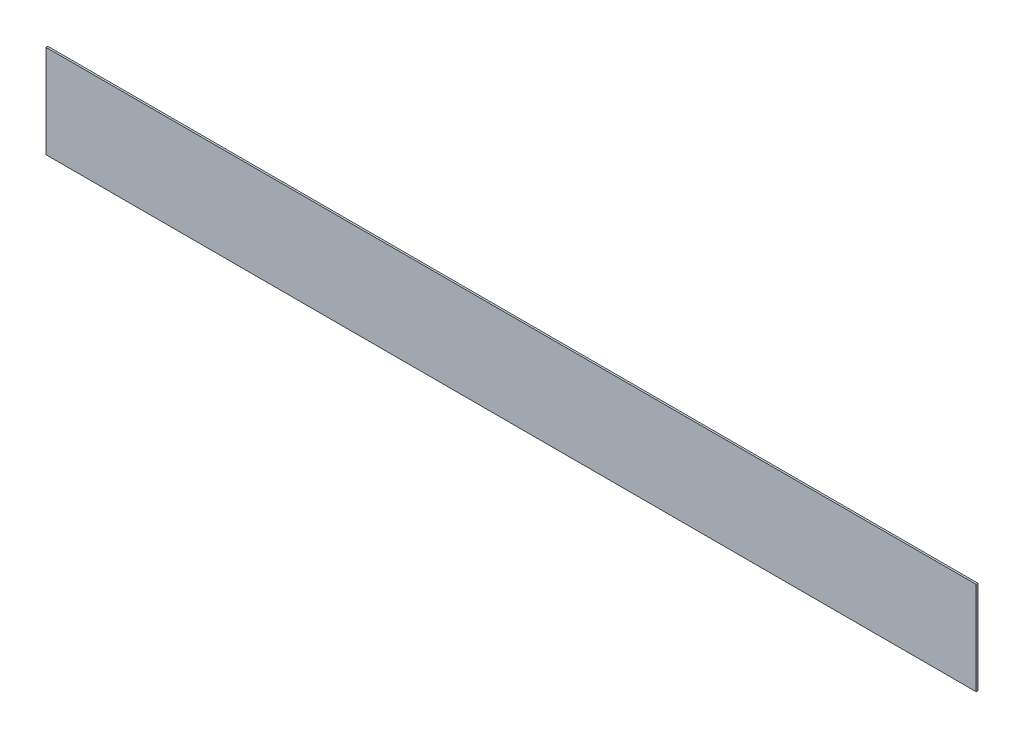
ISO-10303-21;
HEADER;
FILE_DESCRIPTION(('STEP AP214'),'2;1');
FILE_NAME('part.step','',(''),(''),'','','');
FILE_SCHEMA(('AUTOMOTIVE_DESIGN { 1 0 10303 214 1 1 1 1 }'));
ENDSEC;
DATA;
#1=APPLICATION_CONTEXT('core data for automotive mechanical design processes');
#2=APPLICATION_PROTOCOL_DEFINITION('international standard','automotive_design',2000,#1);
#3=PRODUCT_CONTEXT('',#1,'mechanical');
#4=PRODUCT('Part','Part','',(#3));
#5=PRODUCT_RELATED_PRODUCT_CATEGORY('part','',(#4));
#6=PRODUCT_DEFINITION_FORMATION('','',#4);
#7=PRODUCT_DEFINITION_CONTEXT('part definition',#1,'design');
#8=PRODUCT_DEFINITION('design','',#6,#7);
#9=PRODUCT_DEFINITION_SHAPE('','',#8);
#10=(LENGTH_UNIT() NAMED_UNIT(*) SI_UNIT(.MILLI.,.METRE.));
#11=(NAMED_UNIT(*) PLANE_ANGLE_UNIT() SI_UNIT($,.RADIAN.));
#12=(NAMED_UNIT(*) SI_UNIT($,.STERADIAN.) SOLID_ANGLE_UNIT());
#13=UNCERTAINTY_MEASURE_WITH_UNIT(LENGTH_MEASURE(1.E-05),#10,'distance_accuracy_value','');
#14=(GEOMETRIC_REPRESENTATION_CONTEXT(3) GLOBAL_UNCERTAINTY_ASSIGNED_CONTEXT((#13)) GLOBAL_UNIT_ASSIGNED_CONTEXT((#10,
#11,#12)) REPRESENTATION_CONTEXT('',''));
#15=CARTESIAN_POINT('',(0.,0.,0.));
#16=DIRECTION('',(0.,0.,1.));
#17=DIRECTION('',(1.,0.,0.));
#18=AXIS2_PLACEMENT_3D('',#15,#16,#17);
#19=CARTESIAN_POINT('',(0.,0.,10.));
#20=DIRECTION('',(1.,0.,0.));
#21=DIRECTION('',(0.,0.,-1.));
#22=AXIS2_PLACEMENT_3D('',#19,#20,#21);
#23=PLANE('',#22);
#24=DIRECTION('',(0.,-1.,0.));
#25=VECTOR('',#24,1.);
#26=CARTESIAN_POINT('',(0.,0.,0.));
#27=LINE('',#26,#25);
#28=CARTESIAN_POINT('',(0.,500.,0.));
#29=VERTEX_POINT('',#28);
#30=CARTESIAN_POINT('',(0.,0.,0.));
#31=VERTEX_POINT('',#30);
#32=EDGE_CURVE('E95',#29,#31,#27,.T.);
#33=ORIENTED_EDGE('',*,*,#32,.T.);
#34=DIRECTION('',(0.,0.,-1.));
#35=VECTOR('',#34,1.);
#36=CARTESIAN_POINT('',(0.,0.,10.));
#37=LINE('',#36,#35);
#38=CARTESIAN_POINT('',(0.,0.,10.));
#39=VERTEX_POINT('',#38);
#40=EDGE_CURVE('E11',#39,#31,#37,.T.);
#41=ORIENTED_EDGE('',*,*,#40,.F.);
#42=DIRECTION('',(0.,-1.,0.));
#43=VECTOR('',#42,1.);
#44=CARTESIAN_POINT('',(0.,0.,10.));
#45=LINE('',#44,#43);
#46=CARTESIAN_POINT('',(0.,500.,10.));
#47=VERTEX_POINT('',#46);
#48=EDGE_CURVE('E83',#47,#39,#45,.T.);
#49=ORIENTED_EDGE('',*,*,#48,.F.);
#50=DIRECTION('',(0.,0.,-1.));
#51=VECTOR('',#50,1.);
#52=CARTESIAN_POINT('',(0.,500.,10.));
#53=LINE('',#52,#51);
#54=EDGE_CURVE('E91',#47,#29,#53,.T.);
#55=ORIENTED_EDGE('',*,*,#54,.T.);
#56=EDGE_LOOP('',(#33,#41,#49,#55));
#57=FACE_BOUND('',#56,.T.);
#58=ADVANCED_FACE('F32',(#57),#23,.F.);
#59=CARTESIAN_POINT('',(0.,0.,10.));
#60=DIRECTION('',(0.,1.,0.));
#61=DIRECTION('',(0.,0.,1.));
#62=AXIS2_PLACEMENT_3D('',#59,#60,#61);
#63=PLANE('',#62);
#64=DIRECTION('',(1.,0.,0.));
#65=VECTOR('',#64,1.);
#66=CARTESIAN_POINT('',(0.,0.,0.));
#67=LINE('',#66,#65);
#68=CARTESIAN_POINT('',(5000.,0.,0.));
#69=VERTEX_POINT('',#68);
#70=EDGE_CURVE('E87',#31,#69,#67,.T.);
#71=ORIENTED_EDGE('',*,*,#70,.T.);
#72=DIRECTION('',(0.,0.,-1.));
#73=VECTOR('',#72,1.);
#74=CARTESIAN_POINT('',(5000.,0.,10.));
#75=LINE('',#74,#73);
#76=CARTESIAN_POINT('',(5000.,0.,10.));
#77=VERTEX_POINT('',#76);
#78=EDGE_CURVE('E40',#77,#69,#75,.T.);
#79=ORIENTED_EDGE('',*,*,#78,.F.);
#80=DIRECTION('',(1.,0.,0.));
#81=VECTOR('',#80,1.);
#82=CARTESIAN_POINT('',(0.,0.,10.));
#83=LINE('',#82,#81);
#84=EDGE_CURVE('E78',#39,#77,#83,.T.);
#85=ORIENTED_EDGE('',*,*,#84,.F.);
#86=ORIENTED_EDGE('',*,*,#40,.T.);
#87=EDGE_LOOP('',(#71,#79,#85,#86));
#88=FACE_BOUND('',#87,.T.);
#89=ADVANCED_FACE('F86',(#88),#63,.F.);
#90=CARTESIAN_POINT('',(5000.,0.,10.));
#91=DIRECTION('',(-1.,0.,0.));
#92=DIRECTION('',(0.,0.,1.));
#93=AXIS2_PLACEMENT_3D('',#90,#91,#92);
#94=PLANE('',#93);
#95=DIRECTION('',(0.,1.,0.));
#96=VECTOR('',#95,1.);
#97=CARTESIAN_POINT('',(5000.,0.,0.));
#98=LINE('',#97,#96);
#99=CARTESIAN_POINT('',(5000.,500.,0.));
#100=VERTEX_POINT('',#99);
#101=EDGE_CURVE('E65',#69,#100,#98,.T.);
#102=ORIENTED_EDGE('',*,*,#101,.T.);
#103=DIRECTION('',(0.,0.,-1.));
#104=VECTOR('',#103,1.);
#105=CARTESIAN_POINT('',(5000.,500.,10.));
#106=LINE('',#105,#104);
#107=CARTESIAN_POINT('',(5000.,500.,10.));
#108=VERTEX_POINT('',#107);
#109=EDGE_CURVE('E88',#108,#100,#106,.T.);
#110=ORIENTED_EDGE('',*,*,#109,.F.);
#111=DIRECTION('',(0.,1.,0.));
#112=VECTOR('',#111,1.);
#113=CARTESIAN_POINT('',(5000.,0.,10.));
#114=LINE('',#113,#112);
#115=EDGE_CURVE('E81',#77,#108,#114,.T.);
#116=ORIENTED_EDGE('',*,*,#115,.F.);
#117=ORIENTED_EDGE('',*,*,#78,.T.);
#118=EDGE_LOOP('',(#102,#110,#116,#117));
#119=FACE_BOUND('',#118,.T.);
#120=ADVANCED_FACE('F89',(#119),#94,.F.);
#121=CARTESIAN_POINT('',(0.,500.,10.));
#122=DIRECTION('',(0.,-1.,0.));
#123=DIRECTION('',(0.,0.,-1.));
#124=AXIS2_PLACEMENT_3D('',#121,#122,#123);
#125=PLANE('',#124);
#126=DIRECTION('',(-1.,0.,0.));
#127=VECTOR('',#126,1.);
#128=CARTESIAN_POINT('',(0.,500.,0.));
#129=LINE('',#128,#127);
#130=EDGE_CURVE('E71',#100,#29,#129,.T.);
#131=ORIENTED_EDGE('',*,*,#130,.T.);
#132=ORIENTED_EDGE('',*,*,#54,.F.);
#133=DIRECTION('',(-1.,0.,0.));
#134=VECTOR('',#133,1.);
#135=CARTESIAN_POINT('',(0.,500.,10.));
#136=LINE('',#135,#134);
#137=EDGE_CURVE('E48',#108,#47,#136,.T.);
#138=ORIENTED_EDGE('',*,*,#137,.F.);
#139=ORIENTED_EDGE('',*,*,#109,.T.);
#140=EDGE_LOOP('',(#131,#132,#138,#139));
#141=FACE_BOUND('',#140,.T.);
#142=ADVANCED_FACE('F102',(#141),#125,.F.);
#143=CARTESIAN_POINT('',(0.,0.,10.));
#144=DIRECTION('',(0.,0.,-1.));
#145=DIRECTION('',(-1.,0.,0.));
#146=AXIS2_PLACEMENT_3D('',#143,#144,#145);
#147=PLANE('',#146);
#148=ORIENTED_EDGE('',*,*,#48,.T.);
#149=ORIENTED_EDGE('',*,*,#84,.T.);
#150=ORIENTED_EDGE('',*,*,#115,.T.);
#151=ORIENTED_EDGE('',*,*,#137,.T.);
#152=EDGE_LOOP('',(#148,#149,#150,#151));
#153=FACE_BOUND('',#152,.T.);
#154=ADVANCED_FACE('F79',(#153),#147,.F.);
#155=CARTESIAN_POINT('',(0.,0.,0.));
#156=DIRECTION('',(0.,0.,-1.));
#157=DIRECTION('',(-1.,0.,0.));
#158=AXIS2_PLACEMENT_3D('',#155,#156,#157);
#159=PLANE('',#158);
#160=ORIENTED_EDGE('',*,*,#32,.F.);
#161=ORIENTED_EDGE('',*,*,#130,.F.);
#162=ORIENTED_EDGE('',*,*,#101,.F.);
#163=ORIENTED_EDGE('',*,*,#70,.F.);
#164=EDGE_LOOP('',(#160,#161,#162,#163));
#165=FACE_BOUND('',#164,.T.);
#166=ADVANCED_FACE('F105',(#165),#159,.T.);
#167=CLOSED_SHELL('',(#58,#89,#120,#142,#154,#166));
#168=MANIFOLD_SOLID_BREP('B2',#167);
#169=ADVANCED_BREP_SHAPE_REPRESENTATION('',(#18,#168),#14);
#170=SHAPE_DEFINITION_REPRESENTATION(#9,#169);
ENDSEC;
END-ISO-10303-21;
